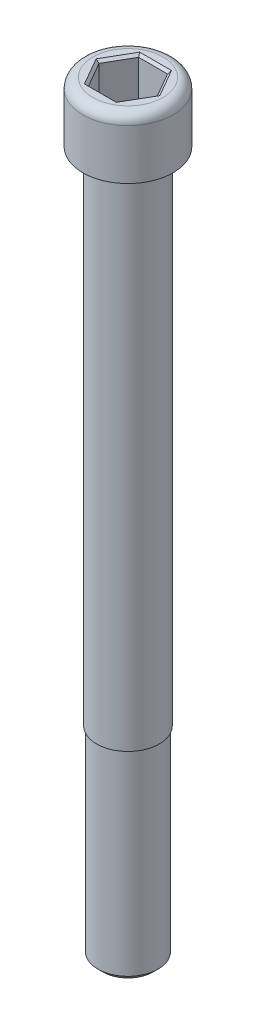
ISO-10303-21;
HEADER;
FILE_DESCRIPTION(('STEP AP214'),'2;1');
FILE_NAME('part.step','',(''),(''),'','','');
FILE_SCHEMA(('AUTOMOTIVE_DESIGN { 1 0 10303 214 1 1 1 1 }'));
ENDSEC;
DATA;
#1=APPLICATION_CONTEXT('core data for automotive mechanical design processes');
#2=APPLICATION_PROTOCOL_DEFINITION('international standard','automotive_design',2000,#1);
#3=PRODUCT_CONTEXT('',#1,'mechanical');
#4=PRODUCT('Part','Part','',(#3));
#5=PRODUCT_RELATED_PRODUCT_CATEGORY('part','',(#4));
#6=PRODUCT_DEFINITION_FORMATION('','',#4);
#7=PRODUCT_DEFINITION_CONTEXT('part definition',#1,'design');
#8=PRODUCT_DEFINITION('design','',#6,#7);
#9=PRODUCT_DEFINITION_SHAPE('','',#8);
#10=(LENGTH_UNIT() NAMED_UNIT(*) SI_UNIT(.MILLI.,.METRE.));
#11=(NAMED_UNIT(*) PLANE_ANGLE_UNIT() SI_UNIT($,.RADIAN.));
#12=(NAMED_UNIT(*) SI_UNIT($,.STERADIAN.) SOLID_ANGLE_UNIT());
#13=UNCERTAINTY_MEASURE_WITH_UNIT(LENGTH_MEASURE(1.E-05),#10,'distance_accuracy_value','');
#14=(GEOMETRIC_REPRESENTATION_CONTEXT(3) GLOBAL_UNCERTAINTY_ASSIGNED_CONTEXT((#13)) GLOBAL_UNIT_ASSIGNED_CONTEXT((#10,
#11,#12)) REPRESENTATION_CONTEXT('',''));
#15=CARTESIAN_POINT('',(0.,0.,0.));
#16=DIRECTION('',(0.,0.,1.));
#17=DIRECTION('',(1.,0.,0.));
#18=AXIS2_PLACEMENT_3D('',#15,#16,#17);
#19=CARTESIAN_POINT('',(0.,144.,0.));
#20=DIRECTION('',(0.,1.,0.));
#21=DIRECTION('',(0.,0.,1.));
#22=AXIS2_PLACEMENT_3D('',#19,#20,#21);
#23=PLANE('',#22);
#24=DIRECTION('',(1.,0.,0.));
#25=VECTOR('',#24,1.);
#26=CARTESIAN_POINT('',(-2.886751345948,144.,5.));
#27=LINE('',#26,#25);
#28=CARTESIAN_POINT('',(-2.88675134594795,144.,4.99999999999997));
#29=VERTEX_POINT('',#28);
#30=CARTESIAN_POINT('',(2.886751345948,144.,5.));
#31=VERTEX_POINT('',#30);
#32=EDGE_CURVE('E372',#29,#31,#27,.T.);
#33=ORIENTED_EDGE('',*,*,#32,.T.);
#34=DIRECTION('',(0.500000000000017,0.,-0.866025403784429));
#35=VECTOR('',#34,1.);
#36=CARTESIAN_POINT('',(2.886751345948,144.,5.));
#37=LINE('',#36,#35);
#38=CARTESIAN_POINT('',(5.77350269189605,144.,0.));
#39=VERTEX_POINT('',#38);
#40=EDGE_CURVE('E367',#31,#39,#37,.T.);
#41=ORIENTED_EDGE('',*,*,#40,.T.);
#42=DIRECTION('',(-0.500000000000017,0.,-0.866025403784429));
#43=VECTOR('',#42,1.);
#44=CARTESIAN_POINT('',(5.773502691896,144.,0.));
#45=LINE('',#44,#43);
#46=CARTESIAN_POINT('',(2.88675134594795,144.,-4.99999999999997));
#47=VERTEX_POINT('',#46);
#48=EDGE_CURVE('E79',#39,#47,#45,.T.);
#49=ORIENTED_EDGE('',*,*,#48,.T.);
#50=DIRECTION('',(-1.,0.,0.));
#51=VECTOR('',#50,1.);
#52=CARTESIAN_POINT('',(2.886751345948,144.,-5.));
#53=LINE('',#52,#51);
#54=CARTESIAN_POINT('',(-2.886751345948,144.,-5.));
#55=VERTEX_POINT('',#54);
#56=EDGE_CURVE('E81',#47,#55,#53,.T.);
#57=ORIENTED_EDGE('',*,*,#56,.T.);
#58=DIRECTION('',(-0.500000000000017,0.,0.866025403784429));
#59=VECTOR('',#58,1.);
#60=CARTESIAN_POINT('',(-2.886751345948,144.,-5.));
#61=LINE('',#60,#59);
#62=CARTESIAN_POINT('',(-5.7735026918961,144.,0.));
#63=VERTEX_POINT('',#62);
#64=EDGE_CURVE('E83',#55,#63,#61,.T.);
#65=ORIENTED_EDGE('',*,*,#64,.T.);
#66=DIRECTION('',(0.500000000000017,0.,0.866025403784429));
#67=VECTOR('',#66,1.);
#68=CARTESIAN_POINT('',(-5.773502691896,144.,0.));
#69=LINE('',#68,#67);
#70=EDGE_CURVE('E399',#63,#29,#69,.T.);
#71=ORIENTED_EDGE('',*,*,#70,.T.);
#72=EDGE_LOOP('',(#33,#41,#49,#57,#65,#71));
#73=FACE_BOUND('',#72,.T.);
#74=ADVANCED_FACE('F17',(#73),#23,.T.);
#75=CARTESIAN_POINT('',(-2.886751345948,152.,-5.));
#76=DIRECTION('',(-0.866025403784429,0.,-0.500000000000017));
#77=DIRECTION('',(-0.500000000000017,0.,0.866025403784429));
#78=AXIS2_PLACEMENT_3D('',#75,#76,#77);
#79=PLANE('',#78);
#80=ORIENTED_EDGE('',*,*,#64,.F.);
#81=DIRECTION('',(0.,1.,0.));
#82=VECTOR('',#81,1.);
#83=CARTESIAN_POINT('',(-2.886751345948,152.,-5.));
#84=LINE('',#83,#82);
#85=CARTESIAN_POINT('',(-2.88675134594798,151.5,-4.99999999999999));
#86=VERTEX_POINT('',#85);
#87=EDGE_CURVE('E88',#55,#86,#84,.T.);
#88=ORIENTED_EDGE('',*,*,#87,.T.);
#89=DIRECTION('',(0.500000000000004,0.,-0.866025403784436));
#90=VECTOR('',#89,1.);
#91=CARTESIAN_POINT('',(-5.77350269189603,151.5,0.));
#92=LINE('',#91,#90);
#93=CARTESIAN_POINT('',(-5.77350269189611,151.5,0.));
#94=VERTEX_POINT('',#93);
#95=EDGE_CURVE('E395',#94,#86,#92,.T.);
#96=ORIENTED_EDGE('',*,*,#95,.F.);
#97=DIRECTION('',(0.,1.,0.));
#98=VECTOR('',#97,1.);
#99=CARTESIAN_POINT('',(-5.773502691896,152.,0.));
#100=LINE('',#99,#98);
#101=EDGE_CURVE('E94',#94,#63,#100,.F.);
#102=ORIENTED_EDGE('',*,*,#101,.T.);
#103=EDGE_LOOP('',(#80,#88,#96,#102));
#104=FACE_BOUND('',#103,.T.);
#105=ADVANCED_FACE('F91',(#104),#79,.F.);
#106=CARTESIAN_POINT('',(2.886751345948,152.,-5.));
#107=DIRECTION('',(0.,0.,-1.));
#108=DIRECTION('',(-1.,0.,0.));
#109=AXIS2_PLACEMENT_3D('',#106,#107,#108);
#110=PLANE('',#109);
#111=ORIENTED_EDGE('',*,*,#56,.F.);
#112=DIRECTION('',(0.,1.,0.));
#113=VECTOR('',#112,1.);
#114=CARTESIAN_POINT('',(2.88675134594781,152.,-4.99999999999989));
#115=LINE('',#114,#113);
#116=CARTESIAN_POINT('',(2.88675134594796,151.5,-4.99999999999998));
#117=VERTEX_POINT('',#116);
#118=EDGE_CURVE('E103',#47,#117,#115,.T.);
#119=ORIENTED_EDGE('',*,*,#118,.T.);
#120=DIRECTION('',(1.,0.,0.));
#121=VECTOR('',#120,1.);
#122=CARTESIAN_POINT('',(0.,151.5,-5.));
#123=LINE('',#122,#121);
#124=EDGE_CURVE('E100',#86,#117,#123,.T.);
#125=ORIENTED_EDGE('',*,*,#124,.F.);
#126=ORIENTED_EDGE('',*,*,#87,.F.);
#127=EDGE_LOOP('',(#111,#119,#125,#126));
#128=FACE_BOUND('',#127,.T.);
#129=ADVANCED_FACE('F98',(#128),#110,.F.);
#130=CARTESIAN_POINT('',(5.773502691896,152.,0.));
#131=DIRECTION('',(0.866025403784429,0.,-0.500000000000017));
#132=DIRECTION('',(-0.500000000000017,0.,-0.866025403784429));
#133=AXIS2_PLACEMENT_3D('',#130,#131,#132);
#134=PLANE('',#133);
#135=ORIENTED_EDGE('',*,*,#48,.F.);
#136=DIRECTION('',(0.,1.,0.));
#137=VECTOR('',#136,1.);
#138=CARTESIAN_POINT('',(5.77350269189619,152.,1.11889664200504E-13));
#139=LINE('',#138,#137);
#140=CARTESIAN_POINT('',(5.77350269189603,151.5,0.));
#141=VERTEX_POINT('',#140);
#142=EDGE_CURVE('E363',#39,#141,#139,.T.);
#143=ORIENTED_EDGE('',*,*,#142,.T.);
#144=DIRECTION('',(0.500000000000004,0.,0.866025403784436));
#145=VECTOR('',#144,1.);
#146=CARTESIAN_POINT('',(2.88675134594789,151.5,-4.99999999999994));
#147=LINE('',#146,#145);
#148=EDGE_CURVE('E387',#117,#141,#147,.T.);
#149=ORIENTED_EDGE('',*,*,#148,.F.);
#150=ORIENTED_EDGE('',*,*,#118,.F.);
#151=EDGE_LOOP('',(#135,#143,#149,#150));
#152=FACE_BOUND('',#151,.T.);
#153=ADVANCED_FACE('F229',(#152),#134,.F.);
#154=CARTESIAN_POINT('',(2.886751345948,152.,5.));
#155=DIRECTION('',(0.866025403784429,0.,0.500000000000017));
#156=DIRECTION('',(0.500000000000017,0.,-0.866025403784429));
#157=AXIS2_PLACEMENT_3D('',#154,#155,#156);
#158=PLANE('',#157);
#159=ORIENTED_EDGE('',*,*,#40,.F.);
#160=DIRECTION('',(0.,1.,0.));
#161=VECTOR('',#160,1.);
#162=CARTESIAN_POINT('',(2.886751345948,152.,5.));
#163=LINE('',#162,#161);
#164=CARTESIAN_POINT('',(2.88675134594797,151.5,4.99999999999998));
#165=VERTEX_POINT('',#164);
#166=EDGE_CURVE('E374',#31,#165,#163,.T.);
#167=ORIENTED_EDGE('',*,*,#166,.T.);
#168=DIRECTION('',(-0.500000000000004,0.,0.866025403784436));
#169=VECTOR('',#168,1.);
#170=CARTESIAN_POINT('',(5.77350269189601,151.5,0.));
#171=LINE('',#170,#169);
#172=EDGE_CURVE('E370',#141,#165,#171,.T.);
#173=ORIENTED_EDGE('',*,*,#172,.F.);
#174=ORIENTED_EDGE('',*,*,#142,.F.);
#175=EDGE_LOOP('',(#159,#167,#173,#174));
#176=FACE_BOUND('',#175,.T.);
#177=ADVANCED_FACE('F225',(#176),#158,.F.);
#178=CARTESIAN_POINT('',(-2.886751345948,152.,5.));
#179=DIRECTION('',(0.,0.,1.));
#180=DIRECTION('',(1.,0.,0.));
#181=AXIS2_PLACEMENT_3D('',#178,#179,#180);
#182=PLANE('',#181);
#183=ORIENTED_EDGE('',*,*,#32,.F.);
#184=DIRECTION('',(0.,1.,0.));
#185=VECTOR('',#184,1.);
#186=CARTESIAN_POINT('',(-2.88675134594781,152.,4.99999999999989));
#187=LINE('',#186,#185);
#188=CARTESIAN_POINT('',(-2.88675134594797,151.5,4.99999999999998));
#189=VERTEX_POINT('',#188);
#190=EDGE_CURVE('E397',#29,#189,#187,.T.);
#191=ORIENTED_EDGE('',*,*,#190,.T.);
#192=DIRECTION('',(1.,0.,0.));
#193=VECTOR('',#192,1.);
#194=CARTESIAN_POINT('',(0.,151.5,5.));
#195=LINE('',#194,#193);
#196=EDGE_CURVE('E411',#165,#189,#195,.F.);
#197=ORIENTED_EDGE('',*,*,#196,.F.);
#198=ORIENTED_EDGE('',*,*,#166,.F.);
#199=EDGE_LOOP('',(#183,#191,#197,#198));
#200=FACE_BOUND('',#199,.T.);
#201=ADVANCED_FACE('F221',(#200),#182,.F.);
#202=CARTESIAN_POINT('',(-5.773502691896,152.,0.));
#203=DIRECTION('',(-0.866025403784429,0.,0.500000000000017));
#204=DIRECTION('',(0.500000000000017,0.,0.866025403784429));
#205=AXIS2_PLACEMENT_3D('',#202,#203,#204);
#206=PLANE('',#205);
#207=ORIENTED_EDGE('',*,*,#70,.F.);
#208=ORIENTED_EDGE('',*,*,#101,.F.);
#209=DIRECTION('',(-0.500000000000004,0.,-0.866025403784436));
#210=VECTOR('',#209,1.);
#211=CARTESIAN_POINT('',(-2.88675134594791,151.5,4.99999999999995));
#212=LINE('',#211,#210);
#213=EDGE_CURVE('E420',#189,#94,#212,.T.);
#214=ORIENTED_EDGE('',*,*,#213,.F.);
#215=ORIENTED_EDGE('',*,*,#190,.F.);
#216=EDGE_LOOP('',(#207,#208,#214,#215));
#217=FACE_BOUND('',#216,.T.);
#218=ADVANCED_FACE('F217',(#217),#206,.F.);
#219=CARTESIAN_POINT('',(-4.546633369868,151.75,-2.625));
#220=DIRECTION('',(0.612372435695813,0.707106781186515,0.353553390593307));
#221=DIRECTION('',(-0.75592894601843,0.654653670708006,0.));
#222=AXIS2_PLACEMENT_3D('',#219,#220,#221);
#223=PLANE('',#222);
#224=DIRECTION('',(0.377964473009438,-0.654653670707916,0.654653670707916));
#225=VECTOR('',#224,1.);
#226=CARTESIAN_POINT('',(-3.175426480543,152.,-5.5));
#227=LINE('',#226,#225);
#228=CARTESIAN_POINT('',(-3.17542648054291,152.,-5.49999999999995));
#229=VERTEX_POINT('',#228);
#230=EDGE_CURVE('E385',#229,#86,#227,.T.);
#231=ORIENTED_EDGE('',*,*,#230,.F.);
#232=DIRECTION('',(0.500000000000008,0.,-0.866025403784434));
#233=VECTOR('',#232,1.);
#234=CARTESIAN_POINT('',(-6.350852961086,152.,0.));
#235=LINE('',#234,#233);
#236=CARTESIAN_POINT('',(-6.35085296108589,152.,0.));
#237=VERTEX_POINT('',#236);
#238=EDGE_CURVE('E148',#237,#229,#235,.T.);
#239=ORIENTED_EDGE('',*,*,#238,.F.);
#240=DIRECTION('',(-0.75592894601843,0.654653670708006,0.));
#241=VECTOR('',#240,1.);
#242=CARTESIAN_POINT('',(-5.19615242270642,151.,0.));
#243=LINE('',#242,#241);
#244=EDGE_CURVE('E150',#94,#237,#243,.T.);
#245=ORIENTED_EDGE('',*,*,#244,.F.);
#246=ORIENTED_EDGE('',*,*,#95,.T.);
#247=EDGE_LOOP('',(#231,#239,#245,#246));
#248=FACE_BOUND('',#247,.T.);
#249=ADVANCED_FACE('F213',(#248),#223,.T.);
#250=CARTESIAN_POINT('',(0.,151.75,-5.25));
#251=DIRECTION('',(0.,0.707106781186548,0.707106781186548));
#252=DIRECTION('',(0.,-0.707106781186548,0.707106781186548));
#253=AXIS2_PLACEMENT_3D('',#250,#251,#252);
#254=PLANE('',#253);
#255=DIRECTION('',(-0.377964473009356,-0.654653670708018,0.654653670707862));
#256=VECTOR('',#255,1.);
#257=CARTESIAN_POINT('',(3.17542648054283,152.,-5.4999999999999));
#258=LINE('',#257,#256);
#259=CARTESIAN_POINT('',(3.17542648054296,152.,-5.49999999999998));
#260=VERTEX_POINT('',#259);
#261=EDGE_CURVE('E382',#260,#117,#258,.T.);
#262=ORIENTED_EDGE('',*,*,#261,.F.);
#263=DIRECTION('',(1.,0.,0.));
#264=VECTOR('',#263,1.);
#265=CARTESIAN_POINT('',(0.,152.,-5.5));
#266=LINE('',#265,#264);
#267=EDGE_CURVE('E145',#229,#260,#266,.T.);
#268=ORIENTED_EDGE('',*,*,#267,.F.);
#269=ORIENTED_EDGE('',*,*,#230,.T.);
#270=ORIENTED_EDGE('',*,*,#124,.T.);
#271=EDGE_LOOP('',(#262,#268,#269,#270));
#272=FACE_BOUND('',#271,.T.);
#273=ADVANCED_FACE('F209',(#272),#254,.T.);
#274=CARTESIAN_POINT('',(4.546633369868,151.75,-2.625));
#275=DIRECTION('',(-0.61237243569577,0.707106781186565,0.353553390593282));
#276=DIRECTION('',(-0.755928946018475,-0.654653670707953,0.));
#277=AXIS2_PLACEMENT_3D('',#274,#275,#276);
#278=PLANE('',#277);
#279=DIRECTION('',(-0.755928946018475,-0.654653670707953,0.));
#280=VECTOR('',#279,1.);
#281=CARTESIAN_POINT('',(5.19615242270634,151.,0.));
#282=LINE('',#281,#280);
#283=CARTESIAN_POINT('',(6.3508529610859,152.,0.));
#284=VERTEX_POINT('',#283);
#285=EDGE_CURVE('E389',#284,#141,#282,.T.);
#286=ORIENTED_EDGE('',*,*,#285,.F.);
#287=DIRECTION('',(0.500000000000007,0.,0.866025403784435));
#288=VECTOR('',#287,1.);
#289=CARTESIAN_POINT('',(3.175426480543,152.,-5.5));
#290=LINE('',#289,#288);
#291=EDGE_CURVE('E142',#260,#284,#290,.T.);
#292=ORIENTED_EDGE('',*,*,#291,.F.);
#293=ORIENTED_EDGE('',*,*,#261,.T.);
#294=ORIENTED_EDGE('',*,*,#148,.T.);
#295=EDGE_LOOP('',(#286,#292,#293,#294));
#296=FACE_BOUND('',#295,.T.);
#297=ADVANCED_FACE('F205',(#296),#278,.T.);
#298=CARTESIAN_POINT('',(4.546633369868,151.75,2.625));
#299=DIRECTION('',(-0.61237243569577,0.707106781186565,-0.353553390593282));
#300=DIRECTION('',(-0.755928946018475,-0.654653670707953,0.));
#301=AXIS2_PLACEMENT_3D('',#298,#299,#300);
#302=PLANE('',#301);
#303=ORIENTED_EDGE('',*,*,#285,.T.);
#304=ORIENTED_EDGE('',*,*,#172,.T.);
#305=DIRECTION('',(-0.377964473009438,-0.654653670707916,-0.654653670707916));
#306=VECTOR('',#305,1.);
#307=CARTESIAN_POINT('',(3.175426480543,152.,5.5));
#308=LINE('',#307,#306);
#309=CARTESIAN_POINT('',(3.17542648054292,152.,5.49999999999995));
#310=VERTEX_POINT('',#309);
#311=EDGE_CURVE('E407',#310,#165,#308,.T.);
#312=ORIENTED_EDGE('',*,*,#311,.F.);
#313=DIRECTION('',(-0.500000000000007,0.,0.866025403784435));
#314=VECTOR('',#313,1.);
#315=CARTESIAN_POINT('',(6.350852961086,152.,0.));
#316=LINE('',#315,#314);
#317=EDGE_CURVE('E132',#284,#310,#316,.T.);
#318=ORIENTED_EDGE('',*,*,#317,.F.);
#319=EDGE_LOOP('',(#303,#304,#312,#318));
#320=FACE_BOUND('',#319,.T.);
#321=ADVANCED_FACE('F201',(#320),#302,.T.);
#322=CARTESIAN_POINT('',(0.,151.75,5.25));
#323=DIRECTION('',(0.,0.707106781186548,-0.707106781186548));
#324=DIRECTION('',(0.,0.707106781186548,0.707106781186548));
#325=AXIS2_PLACEMENT_3D('',#322,#323,#324);
#326=PLANE('',#325);
#327=ORIENTED_EDGE('',*,*,#311,.T.);
#328=ORIENTED_EDGE('',*,*,#196,.T.);
#329=DIRECTION('',(0.377964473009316,-0.65465367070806,-0.654653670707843));
#330=VECTOR('',#329,1.);
#331=CARTESIAN_POINT('',(-3.17542648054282,152.,5.4999999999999));
#332=LINE('',#331,#330);
#333=CARTESIAN_POINT('',(-3.17542648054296,152.,5.49999999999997));
#334=VERTEX_POINT('',#333);
#335=EDGE_CURVE('E415',#334,#189,#332,.T.);
#336=ORIENTED_EDGE('',*,*,#335,.F.);
#337=DIRECTION('',(1.,0.,0.));
#338=VECTOR('',#337,1.);
#339=CARTESIAN_POINT('',(0.,152.,5.5));
#340=LINE('',#339,#338);
#341=EDGE_CURVE('E126',#310,#334,#340,.F.);
#342=ORIENTED_EDGE('',*,*,#341,.F.);
#343=EDGE_LOOP('',(#327,#328,#336,#342));
#344=FACE_BOUND('',#343,.T.);
#345=ADVANCED_FACE('F197',(#344),#326,.T.);
#346=CARTESIAN_POINT('',(-4.546633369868,151.75,2.625));
#347=DIRECTION('',(0.612372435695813,0.707106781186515,-0.353553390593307));
#348=DIRECTION('',(-0.75592894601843,0.654653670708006,0.));
#349=AXIS2_PLACEMENT_3D('',#346,#347,#348);
#350=PLANE('',#349);
#351=ORIENTED_EDGE('',*,*,#244,.T.);
#352=DIRECTION('',(-0.500000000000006,0.,-0.866025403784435));
#353=VECTOR('',#352,1.);
#354=CARTESIAN_POINT('',(-3.175426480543,152.,5.5));
#355=LINE('',#354,#353);
#356=EDGE_CURVE('E122',#334,#237,#355,.T.);
#357=ORIENTED_EDGE('',*,*,#356,.F.);
#358=ORIENTED_EDGE('',*,*,#335,.T.);
#359=ORIENTED_EDGE('',*,*,#213,.T.);
#360=EDGE_LOOP('',(#351,#357,#358,#359));
#361=FACE_BOUND('',#360,.T.);
#362=ADVANCED_FACE('F193',(#361),#350,.T.);
#363=CARTESIAN_POINT('',(0.,0.,0.));
#364=DIRECTION('',(0.,1.,0.));
#365=DIRECTION('',(0.,0.,1.));
#366=AXIS2_PLACEMENT_3D('',#363,#364,#365);
#367=PLANE('',#366);
#368=CARTESIAN_POINT('',(0.,0.,0.));
#369=DIRECTION('',(0.,1.,0.));
#370=DIRECTION('',(0.,0.,1.));
#371=AXIS2_PLACEMENT_3D('',#368,#369,#370);
#372=CIRCLE('',#371,4.99984958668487);
#373=CARTESIAN_POINT('',(0.,0.,4.99984958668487));
#374=VERTEX_POINT('',#373);
#375=EDGE_CURVE('E120',#374,#374,#372,.T.);
#376=ORIENTED_EDGE('',*,*,#375,.F.);
#377=EDGE_LOOP('',(#376));
#378=FACE_BOUND('',#377,.T.);
#379=ADVANCED_FACE('F189',(#378),#367,.F.);
#380=CARTESIAN_POINT('',(0.,152.,0.));
#381=DIRECTION('',(0.,1.,0.));
#382=DIRECTION('',(0.,0.,1.));
#383=AXIS2_PLACEMENT_3D('',#380,#381,#382);
#384=PLANE('',#383);
#385=ORIENTED_EDGE('',*,*,#341,.T.);
#386=ORIENTED_EDGE('',*,*,#356,.T.);
#387=ORIENTED_EDGE('',*,*,#238,.T.);
#388=ORIENTED_EDGE('',*,*,#267,.T.);
#389=ORIENTED_EDGE('',*,*,#291,.T.);
#390=ORIENTED_EDGE('',*,*,#317,.T.);
#391=EDGE_LOOP('',(#385,#386,#387,#388,#389,#390));
#392=FACE_BOUND('',#391,.T.);
#393=CARTESIAN_POINT('',(0.,152.,0.));
#394=DIRECTION('',(0.,-1.,0.));
#395=DIRECTION('',(1.,0.,0.));
#396=AXIS2_PLACEMENT_3D('',#393,#394,#395);
#397=CIRCLE('',#396,7.);
#398=CARTESIAN_POINT('',(7.,152.,0.));
#399=VERTEX_POINT('',#398);
#400=CARTESIAN_POINT('',(-7.,152.,0.));
#401=VERTEX_POINT('',#400);
#402=EDGE_CURVE('E119',#399,#401,#397,.T.);
#403=ORIENTED_EDGE('',*,*,#402,.F.);
#404=CARTESIAN_POINT('',(0.,152.,0.));
#405=DIRECTION('',(0.,-1.,0.));
#406=DIRECTION('',(-1.,0.,0.));
#407=AXIS2_PLACEMENT_3D('',#404,#405,#406);
#408=CIRCLE('',#407,7.);
#409=EDGE_CURVE('E36',#401,#399,#408,.T.);
#410=ORIENTED_EDGE('',*,*,#409,.F.);
#411=EDGE_LOOP('',(#403,#410));
#412=FACE_BOUND('',#411,.T.);
#413=ADVANCED_FACE('F180',(#392,#412),#384,.T.);
#414=CARTESIAN_POINT('',(0.,1.00010348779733,0.));
#415=DIRECTION('',(0.,1.,0.));
#416=DIRECTION('',(0.,0.,1.));
#417=AXIS2_PLACEMENT_3D('',#414,#415,#416);
#418=CONICAL_SURFACE('',#417,5.99992298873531,0.785383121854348);
#419=CARTESIAN_POINT('',(0.,1.0001805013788,0.));
#420=DIRECTION('',(0.,1.,0.));
#421=DIRECTION('',(0.,0.,1.));
#422=AXIS2_PLACEMENT_3D('',#419,#420,#421);
#423=CIRCLE('',#422,6.);
#424=CARTESIAN_POINT('',(0.,1.0001805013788,6.));
#425=VERTEX_POINT('',#424);
#426=EDGE_CURVE('E116',#425,#425,#423,.T.);
#427=ORIENTED_EDGE('',*,*,#426,.F.);
#428=EDGE_LOOP('',(#427));
#429=FACE_BOUND('',#428,.T.);
#430=ORIENTED_EDGE('',*,*,#375,.T.);
#431=EDGE_LOOP('',(#430));
#432=FACE_BOUND('',#431,.T.);
#433=ADVANCED_FACE('F168',(#429,#432),#418,.T.);
#434=CARTESIAN_POINT('',(0.,150.,0.));
#435=DIRECTION('',(0.,1.,0.));
#436=DIRECTION('',(-0.999653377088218,0.,-0.0263272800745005));
#437=AXIS2_PLACEMENT_3D('',#434,#435,#436);
#438=TOROIDAL_SURFACE('',#437,7.,2.);
#439=CARTESIAN_POINT('',(0.,150.,0.));
#440=DIRECTION('',(0.,1.,0.));
#441=DIRECTION('',(0.,0.,1.));
#442=AXIS2_PLACEMENT_3D('',#439,#440,#441);
#443=CIRCLE('',#442,9.);
#444=CARTESIAN_POINT('',(0.,150.,9.));
#445=VERTEX_POINT('',#444);
#446=EDGE_CURVE('E115',#445,#445,#443,.F.);
#447=ORIENTED_EDGE('',*,*,#446,.F.);
#448=EDGE_LOOP('',(#447));
#449=FACE_BOUND('',#448,.T.);
#450=ORIENTED_EDGE('',*,*,#402,.T.);
#451=ORIENTED_EDGE('',*,*,#409,.T.);
#452=EDGE_LOOP('',(#450,#451));
#453=FACE_BOUND('',#452,.T.);
#454=ADVANCED_FACE('F156',(#449,#453),#438,.T.);
#455=CARTESIAN_POINT('',(0.,0.,0.));
#456=DIRECTION('',(0.,1.,0.));
#457=DIRECTION('',(0.,0.,1.));
#458=AXIS2_PLACEMENT_3D('',#455,#456,#457);
#459=CYLINDRICAL_SURFACE('',#458,6.);
#460=CARTESIAN_POINT('',(0.,40.,0.));
#461=DIRECTION('',(0.,1.,0.));
#462=DIRECTION('',(0.,0.,1.));
#463=AXIS2_PLACEMENT_3D('',#460,#461,#462);
#464=CIRCLE('',#463,6.);
#465=CARTESIAN_POINT('',(0.,40.,6.));
#466=VERTEX_POINT('',#465);
#467=EDGE_CURVE('E112',#466,#466,#464,.F.);
#468=ORIENTED_EDGE('',*,*,#467,.T.);
#469=EDGE_LOOP('',(#468));
#470=FACE_BOUND('',#469,.T.);
#471=ORIENTED_EDGE('',*,*,#426,.T.);
#472=EDGE_LOOP('',(#471));
#473=FACE_BOUND('',#472,.T.);
#474=ADVANCED_FACE('F167',(#470,#473),#459,.T.);
#475=CARTESIAN_POINT('',(0.,140.,0.));
#476=DIRECTION('',(0.,1.,0.));
#477=DIRECTION('',(0.,0.,1.));
#478=AXIS2_PLACEMENT_3D('',#475,#476,#477);
#479=CYLINDRICAL_SURFACE('',#478,9.);
#480=CARTESIAN_POINT('',(0.,140.,0.));
#481=DIRECTION('',(0.,1.,0.));
#482=DIRECTION('',(0.,0.,1.));
#483=AXIS2_PLACEMENT_3D('',#480,#481,#482);
#484=CIRCLE('',#483,9.);
#485=CARTESIAN_POINT('',(0.,140.,9.));
#486=VERTEX_POINT('',#485);
#487=EDGE_CURVE('E109',#486,#486,#484,.T.);
#488=ORIENTED_EDGE('',*,*,#487,.T.);
#489=EDGE_LOOP('',(#488));
#490=FACE_BOUND('',#489,.T.);
#491=ORIENTED_EDGE('',*,*,#446,.T.);
#492=EDGE_LOOP('',(#491));
#493=FACE_BOUND('',#492,.T.);
#494=ADVANCED_FACE('F254',(#490,#493),#479,.T.);
#495=CARTESIAN_POINT('',(0.,40.,0.));
#496=DIRECTION('',(0.,1.,0.));
#497=DIRECTION('',(0.,0.,1.));
#498=AXIS2_PLACEMENT_3D('',#495,#496,#497);
#499=PLANE('',#498);
#500=ORIENTED_EDGE('',*,*,#467,.F.);
#501=EDGE_LOOP('',(#500));
#502=FACE_BOUND('',#501,.T.);
#503=CARTESIAN_POINT('',(0.,40.,0.));
#504=DIRECTION('',(0.,1.,0.));
#505=DIRECTION('',(0.,0.,1.));
#506=AXIS2_PLACEMENT_3D('',#503,#504,#505);
#507=CIRCLE('',#506,6.25);
#508=CARTESIAN_POINT('',(0.,40.,6.25));
#509=VERTEX_POINT('',#508);
#510=EDGE_CURVE('E28',#509,#509,#507,.T.);
#511=ORIENTED_EDGE('',*,*,#510,.F.);
#512=EDGE_LOOP('',(#511));
#513=FACE_BOUND('',#512,.T.);
#514=ADVANCED_FACE('F248',(#502,#513),#499,.F.);
#515=CARTESIAN_POINT('',(0.,140.,0.));
#516=DIRECTION('',(0.,1.,0.));
#517=DIRECTION('',(0.,0.,1.));
#518=AXIS2_PLACEMENT_3D('',#515,#516,#517);
#519=PLANE('',#518);
#520=CARTESIAN_POINT('',(0.,140.,0.));
#521=DIRECTION('',(0.,1.,0.));
#522=DIRECTION('',(0.,0.,1.));
#523=AXIS2_PLACEMENT_3D('',#520,#521,#522);
#524=CIRCLE('',#523,6.25);
#525=CARTESIAN_POINT('',(0.,140.,6.25));
#526=VERTEX_POINT('',#525);
#527=EDGE_CURVE('E11',#526,#526,#524,.F.);
#528=ORIENTED_EDGE('',*,*,#527,.F.);
#529=EDGE_LOOP('',(#528));
#530=FACE_BOUND('',#529,.T.);
#531=ORIENTED_EDGE('',*,*,#487,.F.);
#532=EDGE_LOOP('',(#531));
#533=FACE_BOUND('',#532,.T.);
#534=ADVANCED_FACE('F242',(#530,#533),#519,.F.);
#535=CARTESIAN_POINT('',(0.,40.,0.));
#536=DIRECTION('',(0.,1.,0.));
#537=DIRECTION('',(0.,0.,1.));
#538=AXIS2_PLACEMENT_3D('',#535,#536,#537);
#539=CYLINDRICAL_SURFACE('',#538,6.25);
#540=ORIENTED_EDGE('',*,*,#510,.T.);
#541=EDGE_LOOP('',(#540));
#542=FACE_BOUND('',#541,.T.);
#543=ORIENTED_EDGE('',*,*,#527,.T.);
#544=EDGE_LOOP('',(#543));
#545=FACE_BOUND('',#544,.T.);
#546=ADVANCED_FACE('F240',(#542,#545),#539,.T.);
#547=CLOSED_SHELL('',(#74,#105,#129,#153,#177,#201,#218,#249,#273,#297,#321,#345,#362,#379,#413,
#433,#454,#474,#494,#514,#534,#546));
#548=MANIFOLD_SOLID_BREP('B1',#547);
#549=ADVANCED_BREP_SHAPE_REPRESENTATION('',(#18,#548),#14);
#550=SHAPE_DEFINITION_REPRESENTATION(#9,#549);
ENDSEC;
END-ISO-10303-21;
